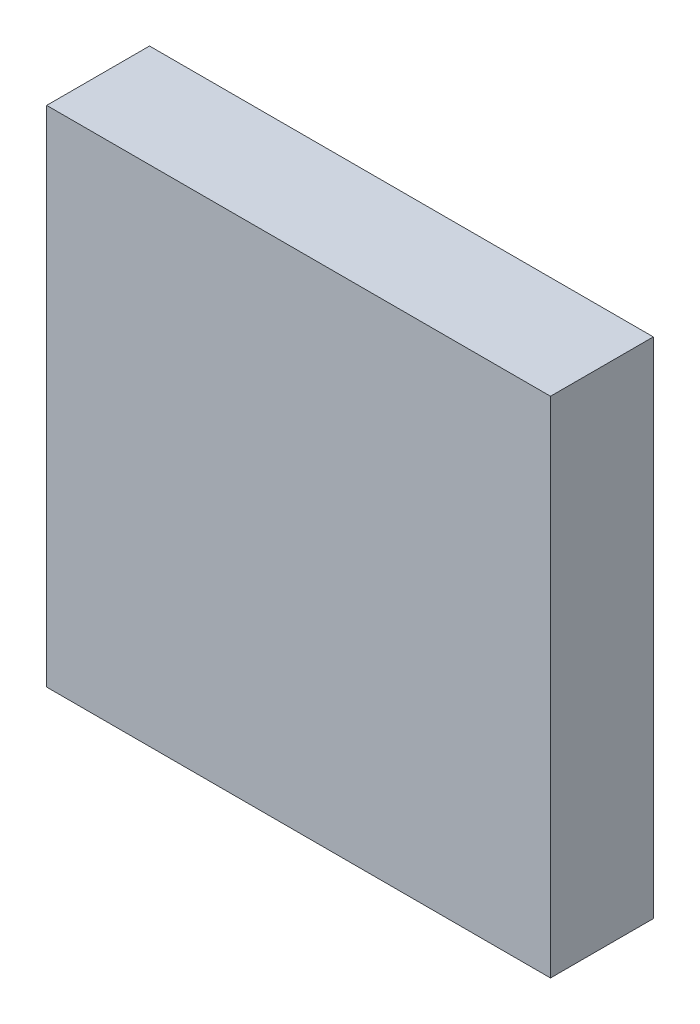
ISO-10303-21;
HEADER;
FILE_DESCRIPTION(('STEP AP214'),'2;1');
FILE_NAME('part.step','',(''),(''),'','','');
FILE_SCHEMA(('AUTOMOTIVE_DESIGN { 1 0 10303 214 1 1 1 1 }'));
ENDSEC;
DATA;
#1=APPLICATION_CONTEXT('core data for automotive mechanical design processes');
#2=APPLICATION_PROTOCOL_DEFINITION('international standard','automotive_design',2000,#1);
#3=PRODUCT_CONTEXT('',#1,'mechanical');
#4=PRODUCT('Part','Part','',(#3));
#5=PRODUCT_RELATED_PRODUCT_CATEGORY('part','',(#4));
#6=PRODUCT_DEFINITION_FORMATION('','',#4);
#7=PRODUCT_DEFINITION_CONTEXT('part definition',#1,'design');
#8=PRODUCT_DEFINITION('design','',#6,#7);
#9=PRODUCT_DEFINITION_SHAPE('','',#8);
#10=(LENGTH_UNIT() NAMED_UNIT(*) SI_UNIT(.MILLI.,.METRE.));
#11=(NAMED_UNIT(*) PLANE_ANGLE_UNIT() SI_UNIT($,.RADIAN.));
#12=(NAMED_UNIT(*) SI_UNIT($,.STERADIAN.) SOLID_ANGLE_UNIT());
#13=UNCERTAINTY_MEASURE_WITH_UNIT(LENGTH_MEASURE(1.E-05),#10,'distance_accuracy_value','');
#14=(GEOMETRIC_REPRESENTATION_CONTEXT(3) GLOBAL_UNCERTAINTY_ASSIGNED_CONTEXT((#13)) GLOBAL_UNIT_ASSIGNED_CONTEXT((#10,
#11,#12)) REPRESENTATION_CONTEXT('',''));
#15=CARTESIAN_POINT('',(0.,0.,0.));
#16=DIRECTION('',(0.,0.,1.));
#17=DIRECTION('',(1.,0.,0.));
#18=AXIS2_PLACEMENT_3D('',#15,#16,#17);
#19=CARTESIAN_POINT('',(0.,0.,1.));
#20=DIRECTION('',(1.,0.,0.));
#21=DIRECTION('',(0.,0.,-1.));
#22=AXIS2_PLACEMENT_3D('',#19,#20,#21);
#23=PLANE('',#22);
#24=DIRECTION('',(0.,-1.,0.));
#25=VECTOR('',#24,1.);
#26=CARTESIAN_POINT('',(0.,0.,0.));
#27=LINE('',#26,#25);
#28=CARTESIAN_POINT('',(0.,4.9,0.));
#29=VERTEX_POINT('',#28);
#30=CARTESIAN_POINT('',(0.,0.,0.));
#31=VERTEX_POINT('',#30);
#32=EDGE_CURVE('E97',#29,#31,#27,.T.);
#33=ORIENTED_EDGE('',*,*,#32,.T.);
#34=DIRECTION('',(0.,0.,-1.));
#35=VECTOR('',#34,1.);
#36=CARTESIAN_POINT('',(0.,0.,1.));
#37=LINE('',#36,#35);
#38=CARTESIAN_POINT('',(0.,0.,1.));
#39=VERTEX_POINT('',#38);
#40=EDGE_CURVE('E11',#39,#31,#37,.T.);
#41=ORIENTED_EDGE('',*,*,#40,.F.);
#42=DIRECTION('',(0.,-1.,0.));
#43=VECTOR('',#42,1.);
#44=CARTESIAN_POINT('',(0.,0.,1.));
#45=LINE('',#44,#43);
#46=CARTESIAN_POINT('',(0.,4.9,1.));
#47=VERTEX_POINT('',#46);
#48=EDGE_CURVE('E85',#47,#39,#45,.T.);
#49=ORIENTED_EDGE('',*,*,#48,.F.);
#50=DIRECTION('',(0.,0.,-1.));
#51=VECTOR('',#50,1.);
#52=CARTESIAN_POINT('',(0.,4.9,1.));
#53=LINE('',#52,#51);
#54=EDGE_CURVE('E93',#47,#29,#53,.T.);
#55=ORIENTED_EDGE('',*,*,#54,.T.);
#56=EDGE_LOOP('',(#33,#41,#49,#55));
#57=FACE_BOUND('',#56,.T.);
#58=ADVANCED_FACE('F34',(#57),#23,.F.);
#59=CARTESIAN_POINT('',(0.,0.,1.));
#60=DIRECTION('',(0.,1.,0.));
#61=DIRECTION('',(0.,0.,1.));
#62=AXIS2_PLACEMENT_3D('',#59,#60,#61);
#63=PLANE('',#62);
#64=DIRECTION('',(1.,0.,0.));
#65=VECTOR('',#64,1.);
#66=CARTESIAN_POINT('',(0.,0.,0.));
#67=LINE('',#66,#65);
#68=CARTESIAN_POINT('',(4.9,0.,0.));
#69=VERTEX_POINT('',#68);
#70=EDGE_CURVE('E89',#31,#69,#67,.T.);
#71=ORIENTED_EDGE('',*,*,#70,.T.);
#72=DIRECTION('',(0.,0.,-1.));
#73=VECTOR('',#72,1.);
#74=CARTESIAN_POINT('',(4.9,0.,1.));
#75=LINE('',#74,#73);
#76=CARTESIAN_POINT('',(4.9,0.,1.));
#77=VERTEX_POINT('',#76);
#78=EDGE_CURVE('E42',#77,#69,#75,.T.);
#79=ORIENTED_EDGE('',*,*,#78,.F.);
#80=DIRECTION('',(1.,0.,0.));
#81=VECTOR('',#80,1.);
#82=CARTESIAN_POINT('',(0.,0.,1.));
#83=LINE('',#82,#81);
#84=EDGE_CURVE('E80',#39,#77,#83,.T.);
#85=ORIENTED_EDGE('',*,*,#84,.F.);
#86=ORIENTED_EDGE('',*,*,#40,.T.);
#87=EDGE_LOOP('',(#71,#79,#85,#86));
#88=FACE_BOUND('',#87,.T.);
#89=ADVANCED_FACE('F88',(#88),#63,.F.);
#90=CARTESIAN_POINT('',(4.9,0.,1.));
#91=DIRECTION('',(-1.,0.,0.));
#92=DIRECTION('',(0.,0.,1.));
#93=AXIS2_PLACEMENT_3D('',#90,#91,#92);
#94=PLANE('',#93);
#95=DIRECTION('',(0.,1.,0.));
#96=VECTOR('',#95,1.);
#97=CARTESIAN_POINT('',(4.9,0.,0.));
#98=LINE('',#97,#96);
#99=CARTESIAN_POINT('',(4.9,4.9,0.));
#100=VERTEX_POINT('',#99);
#101=EDGE_CURVE('E67',#69,#100,#98,.T.);
#102=ORIENTED_EDGE('',*,*,#101,.T.);
#103=DIRECTION('',(0.,0.,-1.));
#104=VECTOR('',#103,1.);
#105=CARTESIAN_POINT('',(4.9,4.9,1.));
#106=LINE('',#105,#104);
#107=CARTESIAN_POINT('',(4.9,4.9,1.));
#108=VERTEX_POINT('',#107);
#109=EDGE_CURVE('E90',#108,#100,#106,.T.);
#110=ORIENTED_EDGE('',*,*,#109,.F.);
#111=DIRECTION('',(0.,1.,0.));
#112=VECTOR('',#111,1.);
#113=CARTESIAN_POINT('',(4.9,0.,1.));
#114=LINE('',#113,#112);
#115=EDGE_CURVE('E83',#77,#108,#114,.T.);
#116=ORIENTED_EDGE('',*,*,#115,.F.);
#117=ORIENTED_EDGE('',*,*,#78,.T.);
#118=EDGE_LOOP('',(#102,#110,#116,#117));
#119=FACE_BOUND('',#118,.T.);
#120=ADVANCED_FACE('F91',(#119),#94,.F.);
#121=CARTESIAN_POINT('',(0.,4.9,1.));
#122=DIRECTION('',(0.,-1.,0.));
#123=DIRECTION('',(0.,0.,-1.));
#124=AXIS2_PLACEMENT_3D('',#121,#122,#123);
#125=PLANE('',#124);
#126=DIRECTION('',(-1.,0.,0.));
#127=VECTOR('',#126,1.);
#128=CARTESIAN_POINT('',(0.,4.9,0.));
#129=LINE('',#128,#127);
#130=EDGE_CURVE('E73',#100,#29,#129,.T.);
#131=ORIENTED_EDGE('',*,*,#130,.T.);
#132=ORIENTED_EDGE('',*,*,#54,.F.);
#133=DIRECTION('',(-1.,0.,0.));
#134=VECTOR('',#133,1.);
#135=CARTESIAN_POINT('',(0.,4.9,1.));
#136=LINE('',#135,#134);
#137=EDGE_CURVE('E50',#108,#47,#136,.T.);
#138=ORIENTED_EDGE('',*,*,#137,.F.);
#139=ORIENTED_EDGE('',*,*,#109,.T.);
#140=EDGE_LOOP('',(#131,#132,#138,#139));
#141=FACE_BOUND('',#140,.T.);
#142=ADVANCED_FACE('F104',(#141),#125,.F.);
#143=CARTESIAN_POINT('',(0.,4.9,1.));
#144=DIRECTION('',(0.,0.,-1.));
#145=DIRECTION('',(-1.,0.,0.));
#146=AXIS2_PLACEMENT_3D('',#143,#144,#145);
#147=PLANE('',#146);
#148=ORIENTED_EDGE('',*,*,#48,.T.);
#149=ORIENTED_EDGE('',*,*,#84,.T.);
#150=ORIENTED_EDGE('',*,*,#115,.T.);
#151=ORIENTED_EDGE('',*,*,#137,.T.);
#152=EDGE_LOOP('',(#148,#149,#150,#151));
#153=FACE_BOUND('',#152,.T.);
#154=ADVANCED_FACE('F81',(#153),#147,.F.);
#155=CARTESIAN_POINT('',(0.,4.9,0.));
#156=DIRECTION('',(0.,0.,-1.));
#157=DIRECTION('',(-1.,0.,0.));
#158=AXIS2_PLACEMENT_3D('',#155,#156,#157);
#159=PLANE('',#158);
#160=ORIENTED_EDGE('',*,*,#32,.F.);
#161=ORIENTED_EDGE('',*,*,#130,.F.);
#162=ORIENTED_EDGE('',*,*,#101,.F.);
#163=ORIENTED_EDGE('',*,*,#70,.F.);
#164=EDGE_LOOP('',(#160,#161,#162,#163));
#165=FACE_BOUND('',#164,.T.);
#166=ADVANCED_FACE('F107',(#165),#159,.T.);
#167=CLOSED_SHELL('',(#58,#89,#120,#142,#154,#166));
#168=MANIFOLD_SOLID_BREP('B2',#167);
#169=ADVANCED_BREP_SHAPE_REPRESENTATION('',(#18,#168),#14);
#170=SHAPE_DEFINITION_REPRESENTATION(#9,#169);
ENDSEC;
END-ISO-10303-21;
